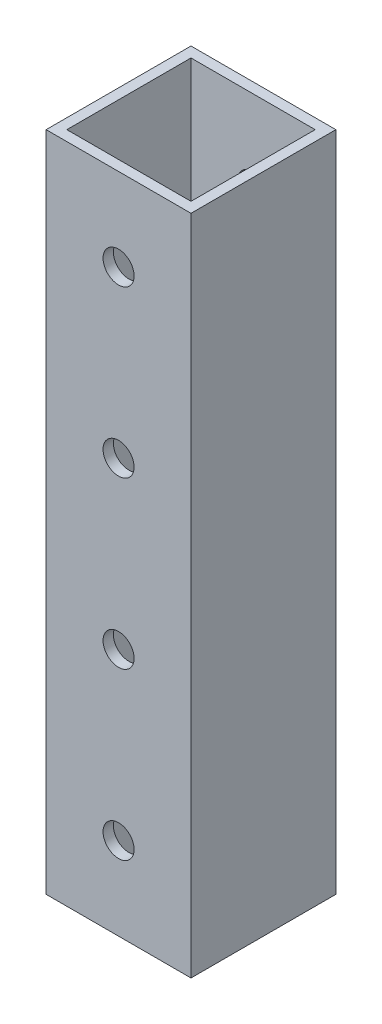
ISO-10303-21;
HEADER;
FILE_DESCRIPTION(('STEP AP214'),'2;1');
FILE_NAME('part.step','',(''),(''),'','','');
FILE_SCHEMA(('AUTOMOTIVE_DESIGN { 1 0 10303 214 1 1 1 1 }'));
ENDSEC;
DATA;
#1=APPLICATION_CONTEXT('core data for automotive mechanical design processes');
#2=APPLICATION_PROTOCOL_DEFINITION('international standard','automotive_design',2000,#1);
#3=PRODUCT_CONTEXT('',#1,'mechanical');
#4=PRODUCT('Part','Part','',(#3));
#5=PRODUCT_RELATED_PRODUCT_CATEGORY('part','',(#4));
#6=PRODUCT_DEFINITION_FORMATION('','',#4);
#7=PRODUCT_DEFINITION_CONTEXT('part definition',#1,'design');
#8=PRODUCT_DEFINITION('design','',#6,#7);
#9=PRODUCT_DEFINITION_SHAPE('','',#8);
#10=(LENGTH_UNIT() NAMED_UNIT(*) SI_UNIT(.MILLI.,.METRE.));
#11=(NAMED_UNIT(*) PLANE_ANGLE_UNIT() SI_UNIT($,.RADIAN.));
#12=(NAMED_UNIT(*) SI_UNIT($,.STERADIAN.) SOLID_ANGLE_UNIT());
#13=UNCERTAINTY_MEASURE_WITH_UNIT(LENGTH_MEASURE(1.E-05),#10,'distance_accuracy_value','');
#14=(GEOMETRIC_REPRESENTATION_CONTEXT(3) GLOBAL_UNCERTAINTY_ASSIGNED_CONTEXT((#13)) GLOBAL_UNIT_ASSIGNED_CONTEXT((#10,
#11,#12)) REPRESENTATION_CONTEXT('',''));
#15=CARTESIAN_POINT('',(0.,0.,0.));
#16=DIRECTION('',(0.,0.,1.));
#17=DIRECTION('',(1.,0.,0.));
#18=AXIS2_PLACEMENT_3D('',#15,#16,#17);
#19=CARTESIAN_POINT('',(-28.575,203.2,-15.875));
#20=DIRECTION('',(1.,0.,0.));
#21=DIRECTION('',(0.,0.,-1.));
#22=AXIS2_PLACEMENT_3D('',#19,#20,#21);
#23=PLANE('',#22);
#24=DIRECTION('',(0.,0.,1.));
#25=VECTOR('',#24,1.);
#26=CARTESIAN_POINT('',(-28.575,0.,-15.875));
#27=LINE('',#26,#25);
#28=CARTESIAN_POINT('',(-28.575,0.,-15.875));
#29=VERTEX_POINT('',#28);
#30=CARTESIAN_POINT('',(-28.575,0.,28.575));
#31=VERTEX_POINT('',#30);
#32=EDGE_CURVE('E163',#29,#31,#27,.T.);
#33=ORIENTED_EDGE('',*,*,#32,.T.);
#34=DIRECTION('',(0.,-1.,0.));
#35=VECTOR('',#34,1.);
#36=CARTESIAN_POINT('',(-28.575,203.2,28.575));
#37=LINE('',#36,#35);
#38=CARTESIAN_POINT('',(-28.575,203.2,28.575));
#39=VERTEX_POINT('',#38);
#40=EDGE_CURVE('E12',#39,#31,#37,.T.);
#41=ORIENTED_EDGE('',*,*,#40,.F.);
#42=DIRECTION('',(0.,0.,1.));
#43=VECTOR('',#42,1.);
#44=CARTESIAN_POINT('',(-28.575,203.2,-15.875));
#45=LINE('',#44,#43);
#46=CARTESIAN_POINT('',(-28.575,203.2,-15.875));
#47=VERTEX_POINT('',#46);
#48=EDGE_CURVE('E167',#47,#39,#45,.T.);
#49=ORIENTED_EDGE('',*,*,#48,.F.);
#50=DIRECTION('',(0.,-1.,0.));
#51=VECTOR('',#50,1.);
#52=CARTESIAN_POINT('',(-28.575,203.2,-15.875));
#53=LINE('',#52,#51);
#54=EDGE_CURVE('E179',#47,#29,#53,.T.);
#55=ORIENTED_EDGE('',*,*,#54,.T.);
#56=EDGE_LOOP('',(#33,#41,#49,#55));
#57=FACE_BOUND('',#56,.T.);
#58=ADVANCED_FACE('F63',(#57),#23,.F.);
#59=CARTESIAN_POINT('',(-28.575,203.2,28.575));
#60=DIRECTION('',(0.,0.,-1.));
#61=DIRECTION('',(-1.,0.,0.));
#62=AXIS2_PLACEMENT_3D('',#59,#60,#61);
#63=PLANE('',#62);
#64=CARTESIAN_POINT('',(-6.35,25.4,28.575));
#65=DIRECTION('',(0.,0.,-1.));
#66=DIRECTION('',(-1.,0.,0.));
#67=AXIS2_PLACEMENT_3D('',#64,#65,#66);
#68=CIRCLE('',#67,4.7625);
#69=CARTESIAN_POINT('',(-11.1125,25.4,28.575));
#70=VERTEX_POINT('',#69);
#71=EDGE_CURVE('E310',#70,#70,#68,.T.);
#72=ORIENTED_EDGE('',*,*,#71,.T.);
#73=EDGE_LOOP('',(#72));
#74=FACE_BOUND('',#73,.T.);
#75=CARTESIAN_POINT('',(-6.35,177.8,28.575));
#76=DIRECTION('',(0.,0.,-1.));
#77=DIRECTION('',(-1.,0.,0.));
#78=AXIS2_PLACEMENT_3D('',#75,#76,#77);
#79=CIRCLE('',#78,4.7625);
#80=CARTESIAN_POINT('',(-11.1125,177.8,28.575));
#81=VERTEX_POINT('',#80);
#82=EDGE_CURVE('E205',#81,#81,#79,.T.);
#83=ORIENTED_EDGE('',*,*,#82,.T.);
#84=EDGE_LOOP('',(#83));
#85=FACE_BOUND('',#84,.T.);
#86=CARTESIAN_POINT('',(-6.35,127.,28.575));
#87=DIRECTION('',(0.,0.,-1.));
#88=DIRECTION('',(-1.,0.,0.));
#89=AXIS2_PLACEMENT_3D('',#86,#87,#88);
#90=CIRCLE('',#89,4.7625);
#91=CARTESIAN_POINT('',(-11.1125,127.,28.575));
#92=VERTEX_POINT('',#91);
#93=EDGE_CURVE('E201',#92,#92,#90,.T.);
#94=ORIENTED_EDGE('',*,*,#93,.T.);
#95=EDGE_LOOP('',(#94));
#96=FACE_BOUND('',#95,.T.);
#97=CARTESIAN_POINT('',(-6.35,76.2,28.575));
#98=DIRECTION('',(0.,0.,-1.));
#99=DIRECTION('',(-1.,0.,0.));
#100=AXIS2_PLACEMENT_3D('',#97,#98,#99);
#101=CIRCLE('',#100,4.7625);
#102=CARTESIAN_POINT('',(-11.1125,76.2,28.575));
#103=VERTEX_POINT('',#102);
#104=EDGE_CURVE('E197',#103,#103,#101,.T.);
#105=ORIENTED_EDGE('',*,*,#104,.T.);
#106=EDGE_LOOP('',(#105));
#107=FACE_BOUND('',#106,.T.);
#108=DIRECTION('',(1.,0.,0.));
#109=VECTOR('',#108,1.);
#110=CARTESIAN_POINT('',(-28.575,0.,28.575));
#111=LINE('',#110,#109);
#112=CARTESIAN_POINT('',(15.875,0.,28.575));
#113=VERTEX_POINT('',#112);
#114=EDGE_CURVE('E182',#31,#113,#111,.T.);
#115=ORIENTED_EDGE('',*,*,#114,.T.);
#116=DIRECTION('',(0.,-1.,0.));
#117=VECTOR('',#116,1.);
#118=CARTESIAN_POINT('',(15.875,203.2,28.575));
#119=LINE('',#118,#117);
#120=CARTESIAN_POINT('',(15.875,203.2,28.575));
#121=VERTEX_POINT('',#120);
#122=EDGE_CURVE('E71',#121,#113,#119,.T.);
#123=ORIENTED_EDGE('',*,*,#122,.F.);
#124=DIRECTION('',(1.,0.,0.));
#125=VECTOR('',#124,1.);
#126=CARTESIAN_POINT('',(-28.575,203.2,28.575));
#127=LINE('',#126,#125);
#128=EDGE_CURVE('E170',#39,#121,#127,.T.);
#129=ORIENTED_EDGE('',*,*,#128,.F.);
#130=ORIENTED_EDGE('',*,*,#40,.T.);
#131=EDGE_LOOP('',(#115,#123,#129,#130));
#132=FACE_BOUND('',#131,.T.);
#133=ADVANCED_FACE('F255',(#74,#85,#96,#107,#132),#63,.F.);
#134=CARTESIAN_POINT('',(15.875,203.2,-15.875));
#135=DIRECTION('',(1.,0.,0.));
#136=DIRECTION('',(0.,0.,-1.));
#137=AXIS2_PLACEMENT_3D('',#134,#135,#136);
#138=PLANE('',#137);
#139=DIRECTION('',(0.,0.,1.));
#140=VECTOR('',#139,1.);
#141=CARTESIAN_POINT('',(15.875,0.,-15.875));
#142=LINE('',#141,#140);
#143=CARTESIAN_POINT('',(15.875,0.,-15.875));
#144=VERTEX_POINT('',#143);
#145=EDGE_CURVE('E185',#144,#113,#142,.T.);
#146=ORIENTED_EDGE('',*,*,#145,.F.);
#147=DIRECTION('',(0.,-1.,0.));
#148=VECTOR('',#147,1.);
#149=CARTESIAN_POINT('',(15.875,203.2,-15.875));
#150=LINE('',#149,#148);
#151=CARTESIAN_POINT('',(15.875,203.2,-15.875));
#152=VERTEX_POINT('',#151);
#153=EDGE_CURVE('E191',#152,#144,#150,.T.);
#154=ORIENTED_EDGE('',*,*,#153,.F.);
#155=DIRECTION('',(0.,0.,1.));
#156=VECTOR('',#155,1.);
#157=CARTESIAN_POINT('',(15.875,203.2,-15.875));
#158=LINE('',#157,#156);
#159=EDGE_CURVE('E173',#152,#121,#158,.T.);
#160=ORIENTED_EDGE('',*,*,#159,.T.);
#161=ORIENTED_EDGE('',*,*,#122,.T.);
#162=EDGE_LOOP('',(#146,#154,#160,#161));
#163=FACE_BOUND('',#162,.T.);
#164=ADVANCED_FACE('F239',(#163),#138,.T.);
#165=CARTESIAN_POINT('',(-28.575,203.2,-15.875));
#166=DIRECTION('',(0.,0.,-1.));
#167=DIRECTION('',(-1.,0.,0.));
#168=AXIS2_PLACEMENT_3D('',#165,#166,#167);
#169=PLANE('',#168);
#170=CARTESIAN_POINT('',(-6.35,25.4,-15.875));
#171=DIRECTION('',(0.,0.,-1.));
#172=DIRECTION('',(-1.,0.,0.));
#173=AXIS2_PLACEMENT_3D('',#170,#171,#172);
#174=CIRCLE('',#173,4.7625);
#175=CARTESIAN_POINT('',(-11.1125,25.4,-15.875));
#176=VERTEX_POINT('',#175);
#177=EDGE_CURVE('E311',#176,#176,#174,.T.);
#178=ORIENTED_EDGE('',*,*,#177,.F.);
#179=EDGE_LOOP('',(#178));
#180=FACE_BOUND('',#179,.T.);
#181=CARTESIAN_POINT('',(-6.35,177.8,-15.875));
#182=DIRECTION('',(0.,0.,-1.));
#183=DIRECTION('',(-1.,0.,0.));
#184=AXIS2_PLACEMENT_3D('',#181,#182,#183);
#185=CIRCLE('',#184,4.7625);
#186=CARTESIAN_POINT('',(-11.1125,177.8,-15.875));
#187=VERTEX_POINT('',#186);
#188=EDGE_CURVE('E212',#187,#187,#185,.T.);
#189=ORIENTED_EDGE('',*,*,#188,.F.);
#190=EDGE_LOOP('',(#189));
#191=FACE_BOUND('',#190,.T.);
#192=CARTESIAN_POINT('',(-6.35,127.,-15.875));
#193=DIRECTION('',(0.,0.,-1.));
#194=DIRECTION('',(-1.,0.,0.));
#195=AXIS2_PLACEMENT_3D('',#192,#193,#194);
#196=CIRCLE('',#195,4.7625);
#197=CARTESIAN_POINT('',(-11.1125,127.,-15.875));
#198=VERTEX_POINT('',#197);
#199=EDGE_CURVE('E209',#198,#198,#196,.T.);
#200=ORIENTED_EDGE('',*,*,#199,.F.);
#201=EDGE_LOOP('',(#200));
#202=FACE_BOUND('',#201,.T.);
#203=CARTESIAN_POINT('',(-6.35,76.2,-15.875));
#204=DIRECTION('',(0.,0.,-1.));
#205=DIRECTION('',(-1.,0.,0.));
#206=AXIS2_PLACEMENT_3D('',#203,#204,#205);
#207=CIRCLE('',#206,4.7625);
#208=CARTESIAN_POINT('',(-11.1125,76.2,-15.875));
#209=VERTEX_POINT('',#208);
#210=EDGE_CURVE('E228',#209,#209,#207,.T.);
#211=ORIENTED_EDGE('',*,*,#210,.F.);
#212=EDGE_LOOP('',(#211));
#213=FACE_BOUND('',#212,.T.);
#214=DIRECTION('',(1.,0.,0.));
#215=VECTOR('',#214,1.);
#216=CARTESIAN_POINT('',(-28.575,0.,-15.875));
#217=LINE('',#216,#215);
#218=EDGE_CURVE('E171',#29,#144,#217,.T.);
#219=ORIENTED_EDGE('',*,*,#218,.F.);
#220=ORIENTED_EDGE('',*,*,#54,.F.);
#221=DIRECTION('',(1.,0.,0.));
#222=VECTOR('',#221,1.);
#223=CARTESIAN_POINT('',(-28.575,203.2,-15.875));
#224=LINE('',#223,#222);
#225=EDGE_CURVE('E176',#47,#152,#224,.T.);
#226=ORIENTED_EDGE('',*,*,#225,.T.);
#227=ORIENTED_EDGE('',*,*,#153,.T.);
#228=EDGE_LOOP('',(#219,#220,#226,#227));
#229=FACE_BOUND('',#228,.T.);
#230=ADVANCED_FACE('F236',(#180,#191,#202,#213,#229),#169,.T.);
#231=CARTESIAN_POINT('',(0.,203.2,0.));
#232=DIRECTION('',(0.,1.,0.));
#233=DIRECTION('',(0.,0.,1.));
#234=AXIS2_PLACEMENT_3D('',#231,#232,#233);
#235=PLANE('',#234);
#236=DIRECTION('',(1.,0.,0.));
#237=VECTOR('',#236,1.);
#238=CARTESIAN_POINT('',(-25.4,203.2,-12.7));
#239=LINE('',#238,#237);
#240=CARTESIAN_POINT('',(-25.4,203.2,-12.7));
#241=VERTEX_POINT('',#240);
#242=CARTESIAN_POINT('',(12.7,203.2,-12.7));
#243=VERTEX_POINT('',#242);
#244=EDGE_CURVE('E131',#241,#243,#239,.T.);
#245=ORIENTED_EDGE('',*,*,#244,.T.);
#246=DIRECTION('',(0.,0.,1.));
#247=VECTOR('',#246,1.);
#248=CARTESIAN_POINT('',(12.7,203.2,-12.7));
#249=LINE('',#248,#247);
#250=CARTESIAN_POINT('',(12.7,203.2,25.4));
#251=VERTEX_POINT('',#250);
#252=EDGE_CURVE('E137',#243,#251,#249,.T.);
#253=ORIENTED_EDGE('',*,*,#252,.T.);
#254=DIRECTION('',(1.,0.,0.));
#255=VECTOR('',#254,1.);
#256=CARTESIAN_POINT('',(-25.4,203.2,25.4));
#257=LINE('',#256,#255);
#258=CARTESIAN_POINT('',(-25.4,203.2,25.4));
#259=VERTEX_POINT('',#258);
#260=EDGE_CURVE('E141',#259,#251,#257,.T.);
#261=ORIENTED_EDGE('',*,*,#260,.F.);
#262=DIRECTION('',(0.,0.,1.));
#263=VECTOR('',#262,1.);
#264=CARTESIAN_POINT('',(-25.4,203.2,-12.7));
#265=LINE('',#264,#263);
#266=EDGE_CURVE('E134',#241,#259,#265,.T.);
#267=ORIENTED_EDGE('',*,*,#266,.F.);
#268=EDGE_LOOP('',(#245,#253,#261,#267));
#269=FACE_BOUND('',#268,.T.);
#270=ORIENTED_EDGE('',*,*,#48,.T.);
#271=ORIENTED_EDGE('',*,*,#128,.T.);
#272=ORIENTED_EDGE('',*,*,#159,.F.);
#273=ORIENTED_EDGE('',*,*,#225,.F.);
#274=EDGE_LOOP('',(#270,#271,#272,#273));
#275=FACE_BOUND('',#274,.T.);
#276=ADVANCED_FACE('F143',(#269,#275),#235,.T.);
#277=CARTESIAN_POINT('',(0.,0.,0.));
#278=DIRECTION('',(0.,1.,0.));
#279=DIRECTION('',(0.,0.,1.));
#280=AXIS2_PLACEMENT_3D('',#277,#278,#279);
#281=PLANE('',#280);
#282=DIRECTION('',(0.,0.,1.));
#283=VECTOR('',#282,1.);
#284=CARTESIAN_POINT('',(12.7,0.,-12.7));
#285=LINE('',#284,#283);
#286=CARTESIAN_POINT('',(12.7,0.,-12.7));
#287=VERTEX_POINT('',#286);
#288=CARTESIAN_POINT('',(12.7,0.,25.4));
#289=VERTEX_POINT('',#288);
#290=EDGE_CURVE('E157',#287,#289,#285,.T.);
#291=ORIENTED_EDGE('',*,*,#290,.F.);
#292=DIRECTION('',(1.,0.,0.));
#293=VECTOR('',#292,1.);
#294=CARTESIAN_POINT('',(-25.4,0.,-12.7));
#295=LINE('',#294,#293);
#296=CARTESIAN_POINT('',(-25.4,0.,-12.7));
#297=VERTEX_POINT('',#296);
#298=EDGE_CURVE('E87',#297,#287,#295,.T.);
#299=ORIENTED_EDGE('',*,*,#298,.F.);
#300=DIRECTION('',(0.,0.,1.));
#301=VECTOR('',#300,1.);
#302=CARTESIAN_POINT('',(-25.4,0.,-12.7));
#303=LINE('',#302,#301);
#304=CARTESIAN_POINT('',(-25.4,0.,25.4));
#305=VERTEX_POINT('',#304);
#306=EDGE_CURVE('E145',#297,#305,#303,.T.);
#307=ORIENTED_EDGE('',*,*,#306,.T.);
#308=DIRECTION('',(1.,0.,0.));
#309=VECTOR('',#308,1.);
#310=CARTESIAN_POINT('',(-25.4,0.,25.4));
#311=LINE('',#310,#309);
#312=EDGE_CURVE('E148',#305,#289,#311,.T.);
#313=ORIENTED_EDGE('',*,*,#312,.T.);
#314=EDGE_LOOP('',(#291,#299,#307,#313));
#315=FACE_BOUND('',#314,.T.);
#316=ORIENTED_EDGE('',*,*,#32,.F.);
#317=ORIENTED_EDGE('',*,*,#218,.T.);
#318=ORIENTED_EDGE('',*,*,#145,.T.);
#319=ORIENTED_EDGE('',*,*,#114,.F.);
#320=EDGE_LOOP('',(#316,#317,#318,#319));
#321=FACE_BOUND('',#320,.T.);
#322=ADVANCED_FACE('F247',(#315,#321),#281,.F.);
#323=CARTESIAN_POINT('',(-25.4,203.2,-12.7));
#324=DIRECTION('',(0.,0.,-1.));
#325=DIRECTION('',(-1.,0.,0.));
#326=AXIS2_PLACEMENT_3D('',#323,#324,#325);
#327=PLANE('',#326);
#328=CARTESIAN_POINT('',(-6.35,25.4,-12.7));
#329=DIRECTION('',(0.,0.,-1.));
#330=DIRECTION('',(-1.,0.,0.));
#331=AXIS2_PLACEMENT_3D('',#328,#329,#330);
#332=CIRCLE('',#331,4.7625);
#333=CARTESIAN_POINT('',(-11.1125,25.4,-12.7));
#334=VERTEX_POINT('',#333);
#335=EDGE_CURVE('E217',#334,#334,#332,.T.);
#336=ORIENTED_EDGE('',*,*,#335,.T.);
#337=EDGE_LOOP('',(#336));
#338=FACE_BOUND('',#337,.T.);
#339=CARTESIAN_POINT('',(-6.35,177.8,-12.7));
#340=DIRECTION('',(0.,0.,-1.));
#341=DIRECTION('',(-1.,0.,0.));
#342=AXIS2_PLACEMENT_3D('',#339,#340,#341);
#343=CIRCLE('',#342,4.7625);
#344=CARTESIAN_POINT('',(-11.1125,177.8,-12.7));
#345=VERTEX_POINT('',#344);
#346=EDGE_CURVE('E204',#345,#345,#343,.T.);
#347=ORIENTED_EDGE('',*,*,#346,.T.);
#348=EDGE_LOOP('',(#347));
#349=FACE_BOUND('',#348,.T.);
#350=CARTESIAN_POINT('',(-6.35,127.,-12.7));
#351=DIRECTION('',(0.,0.,-1.));
#352=DIRECTION('',(-1.,0.,0.));
#353=AXIS2_PLACEMENT_3D('',#350,#351,#352);
#354=CIRCLE('',#353,4.7625);
#355=CARTESIAN_POINT('',(-11.1125,127.,-12.7));
#356=VERTEX_POINT('',#355);
#357=EDGE_CURVE('E200',#356,#356,#354,.T.);
#358=ORIENTED_EDGE('',*,*,#357,.T.);
#359=EDGE_LOOP('',(#358));
#360=FACE_BOUND('',#359,.T.);
#361=CARTESIAN_POINT('',(-6.35,76.2,-12.7));
#362=DIRECTION('',(0.,0.,-1.));
#363=DIRECTION('',(-1.,0.,0.));
#364=AXIS2_PLACEMENT_3D('',#361,#362,#363);
#365=CIRCLE('',#364,4.7625);
#366=CARTESIAN_POINT('',(-11.1125,76.2,-12.7));
#367=VERTEX_POINT('',#366);
#368=EDGE_CURVE('E151',#367,#367,#365,.T.);
#369=ORIENTED_EDGE('',*,*,#368,.T.);
#370=EDGE_LOOP('',(#369));
#371=FACE_BOUND('',#370,.T.);
#372=ORIENTED_EDGE('',*,*,#298,.T.);
#373=DIRECTION('',(0.,-1.,0.));
#374=VECTOR('',#373,1.);
#375=CARTESIAN_POINT('',(12.7,203.2,-12.7));
#376=LINE('',#375,#374);
#377=EDGE_CURVE('E128',#243,#287,#376,.T.);
#378=ORIENTED_EDGE('',*,*,#377,.F.);
#379=ORIENTED_EDGE('',*,*,#244,.F.);
#380=DIRECTION('',(0.,-1.,0.));
#381=VECTOR('',#380,1.);
#382=CARTESIAN_POINT('',(-25.4,203.2,-12.7));
#383=LINE('',#382,#381);
#384=EDGE_CURVE('E161',#241,#297,#383,.T.);
#385=ORIENTED_EDGE('',*,*,#384,.T.);
#386=EDGE_LOOP('',(#372,#378,#379,#385));
#387=FACE_BOUND('',#386,.T.);
#388=ADVANCED_FACE('F129',(#338,#349,#360,#371,#387),#327,.F.);
#389=CARTESIAN_POINT('',(-25.4,203.2,-12.7));
#390=DIRECTION('',(1.,0.,0.));
#391=DIRECTION('',(0.,0.,-1.));
#392=AXIS2_PLACEMENT_3D('',#389,#390,#391);
#393=PLANE('',#392);
#394=ORIENTED_EDGE('',*,*,#306,.F.);
#395=ORIENTED_EDGE('',*,*,#384,.F.);
#396=ORIENTED_EDGE('',*,*,#266,.T.);
#397=DIRECTION('',(0.,-1.,0.));
#398=VECTOR('',#397,1.);
#399=CARTESIAN_POINT('',(-25.4,203.2,25.4));
#400=LINE('',#399,#398);
#401=EDGE_CURVE('E164',#259,#305,#400,.T.);
#402=ORIENTED_EDGE('',*,*,#401,.T.);
#403=EDGE_LOOP('',(#394,#395,#396,#402));
#404=FACE_BOUND('',#403,.T.);
#405=ADVANCED_FACE('F272',(#404),#393,.T.);
#406=CARTESIAN_POINT('',(-25.4,203.2,25.4));
#407=DIRECTION('',(0.,0.,-1.));
#408=DIRECTION('',(-1.,0.,0.));
#409=AXIS2_PLACEMENT_3D('',#406,#407,#408);
#410=PLANE('',#409);
#411=CARTESIAN_POINT('',(-6.35,25.4,25.4));
#412=DIRECTION('',(0.,0.,-1.));
#413=DIRECTION('',(-1.,0.,0.));
#414=AXIS2_PLACEMENT_3D('',#411,#412,#413);
#415=CIRCLE('',#414,4.7625);
#416=CARTESIAN_POINT('',(-11.1125,25.4,25.4));
#417=VERTEX_POINT('',#416);
#418=EDGE_CURVE('E66',#417,#417,#415,.T.);
#419=ORIENTED_EDGE('',*,*,#418,.F.);
#420=EDGE_LOOP('',(#419));
#421=FACE_BOUND('',#420,.T.);
#422=CARTESIAN_POINT('',(-6.35,177.8,25.4));
#423=DIRECTION('',(0.,0.,-1.));
#424=DIRECTION('',(-1.,0.,0.));
#425=AXIS2_PLACEMENT_3D('',#422,#423,#424);
#426=CIRCLE('',#425,4.7625);
#427=CARTESIAN_POINT('',(-11.1125,177.8,25.4));
#428=VERTEX_POINT('',#427);
#429=EDGE_CURVE('E202',#428,#428,#426,.T.);
#430=ORIENTED_EDGE('',*,*,#429,.F.);
#431=EDGE_LOOP('',(#430));
#432=FACE_BOUND('',#431,.T.);
#433=CARTESIAN_POINT('',(-6.35,127.,25.4));
#434=DIRECTION('',(0.,0.,-1.));
#435=DIRECTION('',(-1.,0.,0.));
#436=AXIS2_PLACEMENT_3D('',#433,#434,#435);
#437=CIRCLE('',#436,4.7625);
#438=CARTESIAN_POINT('',(-11.1125,127.,25.4));
#439=VERTEX_POINT('',#438);
#440=EDGE_CURVE('E198',#439,#439,#437,.T.);
#441=ORIENTED_EDGE('',*,*,#440,.F.);
#442=EDGE_LOOP('',(#441));
#443=FACE_BOUND('',#442,.T.);
#444=CARTESIAN_POINT('',(-6.35,76.2,25.4));
#445=DIRECTION('',(0.,0.,-1.));
#446=DIRECTION('',(-1.,0.,0.));
#447=AXIS2_PLACEMENT_3D('',#444,#445,#446);
#448=CIRCLE('',#447,4.7625);
#449=CARTESIAN_POINT('',(-11.1125,76.2,25.4));
#450=VERTEX_POINT('',#449);
#451=EDGE_CURVE('E194',#450,#450,#448,.T.);
#452=ORIENTED_EDGE('',*,*,#451,.F.);
#453=EDGE_LOOP('',(#452));
#454=FACE_BOUND('',#453,.T.);
#455=ORIENTED_EDGE('',*,*,#312,.F.);
#456=ORIENTED_EDGE('',*,*,#401,.F.);
#457=ORIENTED_EDGE('',*,*,#260,.T.);
#458=DIRECTION('',(0.,-1.,0.));
#459=VECTOR('',#458,1.);
#460=CARTESIAN_POINT('',(12.7,203.2,25.4));
#461=LINE('',#460,#459);
#462=EDGE_CURVE('E79',#251,#289,#461,.T.);
#463=ORIENTED_EDGE('',*,*,#462,.T.);
#464=EDGE_LOOP('',(#455,#456,#457,#463));
#465=FACE_BOUND('',#464,.T.);
#466=ADVANCED_FACE('F277',(#421,#432,#443,#454,#465),#410,.T.);
#467=CARTESIAN_POINT('',(12.7,203.2,-12.7));
#468=DIRECTION('',(1.,0.,0.));
#469=DIRECTION('',(0.,0.,-1.));
#470=AXIS2_PLACEMENT_3D('',#467,#468,#469);
#471=PLANE('',#470);
#472=ORIENTED_EDGE('',*,*,#290,.T.);
#473=ORIENTED_EDGE('',*,*,#462,.F.);
#474=ORIENTED_EDGE('',*,*,#252,.F.);
#475=ORIENTED_EDGE('',*,*,#377,.T.);
#476=EDGE_LOOP('',(#472,#473,#474,#475));
#477=FACE_BOUND('',#476,.T.);
#478=ADVANCED_FACE('F138',(#477),#471,.F.);
#479=CARTESIAN_POINT('',(-6.35,76.2,28.575));
#480=DIRECTION('',(0.,0.,-1.));
#481=DIRECTION('',(-1.,0.,0.));
#482=AXIS2_PLACEMENT_3D('',#479,#480,#481);
#483=CYLINDRICAL_SURFACE('',#482,4.7625);
#484=ORIENTED_EDGE('',*,*,#451,.T.);
#485=EDGE_LOOP('',(#484));
#486=FACE_BOUND('',#485,.T.);
#487=ORIENTED_EDGE('',*,*,#104,.F.);
#488=EDGE_LOOP('',(#487));
#489=FACE_BOUND('',#488,.T.);
#490=ADVANCED_FACE('F276',(#486,#489),#483,.F.);
#491=ORIENTED_EDGE('',*,*,#210,.T.);
#492=EDGE_LOOP('',(#491));
#493=FACE_BOUND('',#492,.T.);
#494=ORIENTED_EDGE('',*,*,#368,.F.);
#495=EDGE_LOOP('',(#494));
#496=FACE_BOUND('',#495,.T.);
#497=ADVANCED_FACE('F233',(#493,#496),#483,.F.);
#498=CARTESIAN_POINT('',(-6.35,127.,28.575));
#499=DIRECTION('',(0.,0.,-1.));
#500=DIRECTION('',(-1.,0.,0.));
#501=AXIS2_PLACEMENT_3D('',#498,#499,#500);
#502=CYLINDRICAL_SURFACE('',#501,4.7625);
#503=ORIENTED_EDGE('',*,*,#440,.T.);
#504=EDGE_LOOP('',(#503));
#505=FACE_BOUND('',#504,.T.);
#506=ORIENTED_EDGE('',*,*,#93,.F.);
#507=EDGE_LOOP('',(#506));
#508=FACE_BOUND('',#507,.T.);
#509=ADVANCED_FACE('F287',(#505,#508),#502,.F.);
#510=ORIENTED_EDGE('',*,*,#199,.T.);
#511=EDGE_LOOP('',(#510));
#512=FACE_BOUND('',#511,.T.);
#513=ORIENTED_EDGE('',*,*,#357,.F.);
#514=EDGE_LOOP('',(#513));
#515=FACE_BOUND('',#514,.T.);
#516=ADVANCED_FACE('F290',(#512,#515),#502,.F.);
#517=CARTESIAN_POINT('',(-6.35,177.8,28.575));
#518=DIRECTION('',(0.,0.,-1.));
#519=DIRECTION('',(-1.,0.,0.));
#520=AXIS2_PLACEMENT_3D('',#517,#518,#519);
#521=CYLINDRICAL_SURFACE('',#520,4.7625);
#522=ORIENTED_EDGE('',*,*,#429,.T.);
#523=EDGE_LOOP('',(#522));
#524=FACE_BOUND('',#523,.T.);
#525=ORIENTED_EDGE('',*,*,#82,.F.);
#526=EDGE_LOOP('',(#525));
#527=FACE_BOUND('',#526,.T.);
#528=ADVANCED_FACE('F292',(#524,#527),#521,.F.);
#529=ORIENTED_EDGE('',*,*,#188,.T.);
#530=EDGE_LOOP('',(#529));
#531=FACE_BOUND('',#530,.T.);
#532=ORIENTED_EDGE('',*,*,#346,.F.);
#533=EDGE_LOOP('',(#532));
#534=FACE_BOUND('',#533,.T.);
#535=ADVANCED_FACE('F295',(#531,#534),#521,.F.);
#536=CARTESIAN_POINT('',(-6.35,25.4,28.575));
#537=DIRECTION('',(0.,0.,-1.));
#538=DIRECTION('',(-1.,0.,0.));
#539=AXIS2_PLACEMENT_3D('',#536,#537,#538);
#540=CYLINDRICAL_SURFACE('',#539,4.7625);
#541=ORIENTED_EDGE('',*,*,#418,.T.);
#542=EDGE_LOOP('',(#541));
#543=FACE_BOUND('',#542,.T.);
#544=ORIENTED_EDGE('',*,*,#71,.F.);
#545=EDGE_LOOP('',(#544));
#546=FACE_BOUND('',#545,.T.);
#547=ADVANCED_FACE('F296',(#543,#546),#540,.F.);
#548=ORIENTED_EDGE('',*,*,#177,.T.);
#549=EDGE_LOOP('',(#548));
#550=FACE_BOUND('',#549,.T.);
#551=ORIENTED_EDGE('',*,*,#335,.F.);
#552=EDGE_LOOP('',(#551));
#553=FACE_BOUND('',#552,.T.);
#554=ADVANCED_FACE('F298',(#550,#553),#540,.F.);
#555=CLOSED_SHELL('',(#58,#133,#164,#230,#276,#322,#388,#405,#466,#478,#490,#497,#509,#516,#528,
#535,#547,#554));
#556=MANIFOLD_SOLID_BREP('B2',#555);
#557=ADVANCED_BREP_SHAPE_REPRESENTATION('',(#18,#556),#14);
#558=SHAPE_DEFINITION_REPRESENTATION(#9,#557);
ENDSEC;
END-ISO-10303-21;
